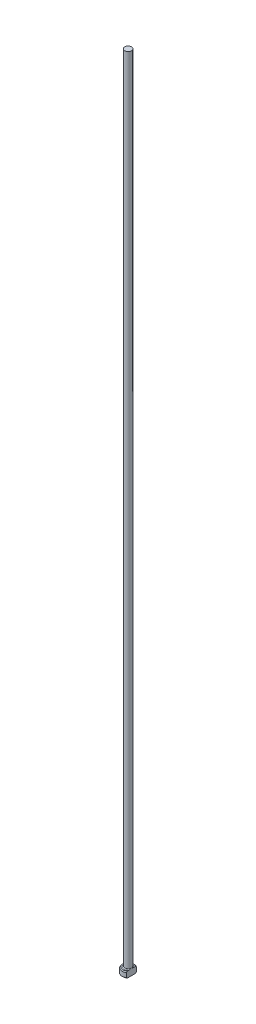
from build123d import *
from build123d.topology import SkipClean

# Parameters (mm, degrees)
CHAMFER1_SIZE = 0.2
FILLET1_R     = 0.2
KEY_DEPTH     = 201.011249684


with BuildPart() as part:
    # Sketch1 → Revolve1 (revolve)
    with BuildSketch(Plane.XY, mode=Mode.PRIVATE) as revolve1_sk:
        Polygon((0, 0), (-1.5, 0), (-1.5, 1.5), (-0.85, 1.5), (-0.85, 200), (0, 200), align=None)
    revolve(revolve1_sk.sketch.rotate(Axis((0, 259.958771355, 0), (0, -1, 0)), 270), axis=Axis((0, 259.958771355, 0), (0, -1, 0)))

    # Chamfer1
    chamfer1_edges = [part.edges().sort_by_distance(p)[0] for p in [
        (0, 1.5, -1.5),
        (0, 0, -1.5),
    ]]
    chamfer(chamfer1_edges, length=CHAMFER1_SIZE)

    # Fillet1
    fillet1_edges = [part.edges().sort_by_distance(p)[0] for p in [
        (0, 1.5, -0.85),
    ]]
    fillet(fillet1_edges, radius=FILLET1_R)

    # Sketch2 → KEY (cut, through all)
    with SkipClean():  # the faces are left unmerged after this step: merging them gives an invalid solid
        with BuildSketch(Plane(origin=(0, 0, 0), x_dir=(1, 0, 0), z_dir=(0, 1, 0))):
            with BuildLine():
                Line((0.85, 1.235920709), (0.85, -1.235920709))
                ThreePointArc((0.85, -1.235920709), (1.5, 0), (0.85, 1.235920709))
            make_face()
        extrude(amount=KEY_DEPTH, mode=Mode.SUBTRACT)


solid = part.part
